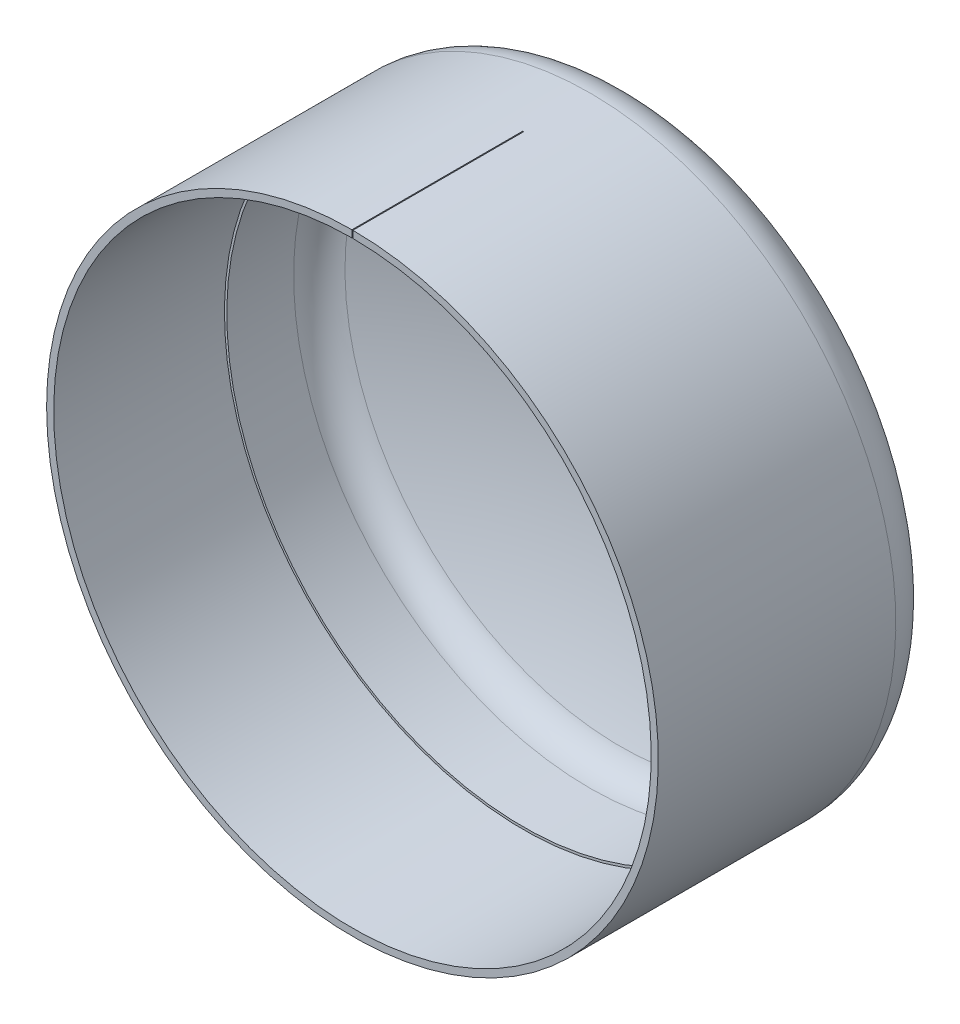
ISO-10303-21;
HEADER;
FILE_DESCRIPTION(('STEP AP214'),'2;1');
FILE_NAME('part.step','',(''),(''),'','','');
FILE_SCHEMA(('AUTOMOTIVE_DESIGN { 1 0 10303 214 1 1 1 1 }'));
ENDSEC;
DATA;
#1=APPLICATION_CONTEXT('core data for automotive mechanical design processes');
#2=APPLICATION_PROTOCOL_DEFINITION('international standard','automotive_design',2000,#1);
#3=PRODUCT_CONTEXT('',#1,'mechanical');
#4=PRODUCT('Part','Part','',(#3));
#5=PRODUCT_RELATED_PRODUCT_CATEGORY('part','',(#4));
#6=PRODUCT_DEFINITION_FORMATION('','',#4);
#7=PRODUCT_DEFINITION_CONTEXT('part definition',#1,'design');
#8=PRODUCT_DEFINITION('design','',#6,#7);
#9=PRODUCT_DEFINITION_SHAPE('','',#8);
#10=(LENGTH_UNIT() NAMED_UNIT(*) SI_UNIT(.MILLI.,.METRE.));
#11=(NAMED_UNIT(*) PLANE_ANGLE_UNIT() SI_UNIT($,.RADIAN.));
#12=(NAMED_UNIT(*) SI_UNIT($,.STERADIAN.) SOLID_ANGLE_UNIT());
#13=UNCERTAINTY_MEASURE_WITH_UNIT(LENGTH_MEASURE(1.E-05),#10,'distance_accuracy_value','');
#14=(GEOMETRIC_REPRESENTATION_CONTEXT(3) GLOBAL_UNCERTAINTY_ASSIGNED_CONTEXT((#13)) GLOBAL_UNIT_ASSIGNED_CONTEXT((#10,
#11,#12)) REPRESENTATION_CONTEXT('',''));
#15=CARTESIAN_POINT('',(0.,0.,0.));
#16=DIRECTION('',(0.,0.,1.));
#17=DIRECTION('',(1.,0.,0.));
#18=AXIS2_PLACEMENT_3D('',#15,#16,#17);
#19=CARTESIAN_POINT('',(204.502774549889,-121.470393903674,-116.874440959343));
#20=DIRECTION('',(0.61388628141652,-0.789394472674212,0.));
#21=DIRECTION('',(0.,0.,-1.));
#22=AXIS2_PLACEMENT_3D('',#19,#20,#21);
#23=SPHERICAL_SURFACE('',#22,153.580357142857);
#24=CARTESIAN_POINT('',(204.502774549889,-121.470393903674,-259.020332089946));
#25=DIRECTION('',(0.,0.,-1.));
#26=DIRECTION('',(0.789394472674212,0.61388628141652,0.));
#27=AXIS2_PLACEMENT_3D('',#24,#25,#26);
#28=CIRCLE('',#27,58.1504233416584);
#29=CARTESIAN_POINT('',(250.40639731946,-85.7726467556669,-259.020332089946));
#30=VERTEX_POINT('',#29);
#31=EDGE_CURVE('E21',#30,#30,#28,.F.);
#32=ORIENTED_EDGE('',*,*,#31,.T.);
#33=EDGE_LOOP('',(#32));
#34=FACE_BOUND('',#33,.T.);
#35=ADVANCED_FACE('F17',(#34),#23,.F.);
#36=CARTESIAN_POINT('',(204.502774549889,-121.470393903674,-252.541500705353));
#37=DIRECTION('',(0.,0.,-1.));
#38=DIRECTION('',(0.789394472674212,0.61388628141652,0.));
#39=AXIS2_PLACEMENT_3D('',#36,#37,#38);
#40=TOROIDAL_SURFACE('',#39,55.5,7.);
#41=CARTESIAN_POINT('',(204.502774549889,-121.470393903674,-252.541500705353));
#42=DIRECTION('',(0.,0.,-1.));
#43=DIRECTION('',(0.,1.,0.));
#44=AXIS2_PLACEMENT_3D('',#41,#42,#43);
#45=CIRCLE('',#44,62.5);
#46=CARTESIAN_POINT('',(204.502774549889,-58.970393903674,-252.541500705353));
#47=VERTEX_POINT('',#46);
#48=EDGE_CURVE('E70',#47,#47,#45,.F.);
#49=ORIENTED_EDGE('',*,*,#48,.T.);
#50=EDGE_LOOP('',(#49));
#51=FACE_BOUND('',#50,.T.);
#52=ORIENTED_EDGE('',*,*,#31,.F.);
#53=EDGE_LOOP('',(#52));
#54=FACE_BOUND('',#53,.T.);
#55=ADVANCED_FACE('F97',(#51,#54),#40,.F.);
#56=CARTESIAN_POINT('',(204.502774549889,-121.470393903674,-245.498149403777));
#57=DIRECTION('',(0.,0.,-1.));
#58=DIRECTION('',(0.,1.,0.));
#59=AXIS2_PLACEMENT_3D('',#56,#57,#58);
#60=CYLINDRICAL_SURFACE('',#59,62.5);
#61=CARTESIAN_POINT('',(204.502774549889,-121.470393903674,-238.4547981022));
#62=DIRECTION('',(0.,0.,-1.));
#63=DIRECTION('',(0.,1.,0.));
#64=AXIS2_PLACEMENT_3D('',#61,#62,#63);
#65=CIRCLE('',#64,62.5);
#66=CARTESIAN_POINT('',(204.502774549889,-58.970393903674,-238.4547981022));
#67=VERTEX_POINT('',#66);
#68=EDGE_CURVE('E77',#67,#67,#65,.T.);
#69=ORIENTED_EDGE('',*,*,#68,.F.);
#70=EDGE_LOOP('',(#69));
#71=FACE_BOUND('',#70,.T.);
#72=ORIENTED_EDGE('',*,*,#48,.F.);
#73=EDGE_LOOP('',(#72));
#74=FACE_BOUND('',#73,.T.);
#75=ADVANCED_FACE('F100',(#71,#74),#60,.F.);
#76=CARTESIAN_POINT('',(165.52099567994,-71.3438448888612,-238.4547981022));
#77=DIRECTION('',(0.,0.,1.));
#78=DIRECTION('',(0.,-1.,0.));
#79=AXIS2_PLACEMENT_3D('',#76,#77,#78);
#80=PLANE('',#79);
#81=ORIENTED_EDGE('',*,*,#68,.T.);
#82=EDGE_LOOP('',(#81));
#83=FACE_BOUND('',#82,.T.);
#84=DIRECTION('',(0.00158730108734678,0.999998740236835,0.));
#85=VECTOR('',#84,1.);
#86=CARTESIAN_POINT('',(204.602774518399,-58.4704732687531,-238.4547981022));
#87=LINE('',#86,#85);
#88=CARTESIAN_POINT('',(204.602774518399,-58.4704732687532,-238.4547981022));
#89=VERTEX_POINT('',#88);
#90=CARTESIAN_POINT('',(204.60515547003,-56.9704751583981,-238.4547981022));
#91=VERTEX_POINT('',#90);
#92=EDGE_CURVE('E69',#89,#91,#87,.T.);
#93=ORIENTED_EDGE('',*,*,#92,.T.);
#94=CARTESIAN_POINT('',(204.502774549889,-121.470393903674,-238.4547981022));
#95=DIRECTION('',(0.,0.,1.));
#96=DIRECTION('',(0.,-1.,0.));
#97=AXIS2_PLACEMENT_3D('',#94,#95,#96);
#98=CIRCLE('',#97,64.5);
#99=CARTESIAN_POINT('',(204.400393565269,-56.9704751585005,-238.4547981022));
#100=VERTEX_POINT('',#99);
#101=EDGE_CURVE('E56',#91,#100,#98,.T.);
#102=ORIENTED_EDGE('',*,*,#101,.T.);
#103=DIRECTION('',(0.00158730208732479,-0.999998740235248,0.));
#104=VECTOR('',#103,1.);
#105=CARTESIAN_POINT('',(204.400393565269,-56.9704751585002,-238.4547981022));
#106=LINE('',#105,#104);
#107=CARTESIAN_POINT('',(204.4027745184,-58.4704732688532,-238.4547981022));
#108=VERTEX_POINT('',#107);
#109=EDGE_CURVE('E62',#100,#108,#106,.T.);
#110=ORIENTED_EDGE('',*,*,#109,.T.);
#111=CARTESIAN_POINT('',(204.502774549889,-121.470393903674,-238.4547981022));
#112=DIRECTION('',(0.,0.,-1.));
#113=DIRECTION('',(-1.,0.,0.));
#114=AXIS2_PLACEMENT_3D('',#111,#112,#113);
#115=CIRCLE('',#114,63.);
#116=EDGE_CURVE('E79',#108,#89,#115,.F.);
#117=ORIENTED_EDGE('',*,*,#116,.T.);
#118=EDGE_LOOP('',(#93,#102,#110,#117));
#119=FACE_BOUND('',#118,.T.);
#120=ADVANCED_FACE('F76',(#83,#119),#80,.T.);
#121=CARTESIAN_POINT('',(204.502774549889,-121.470393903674,-116.874440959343));
#122=DIRECTION('',(0.61388628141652,-0.789394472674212,0.));
#123=DIRECTION('',(0.,0.,-1.));
#124=AXIS2_PLACEMENT_3D('',#121,#122,#123);
#125=SPHERICAL_SURFACE('',#124,155.580357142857);
#126=CARTESIAN_POINT('',(204.502774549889,-121.470393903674,-260.871426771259));
#127=DIRECTION('',(0.,0.,-1.));
#128=DIRECTION('',(0.789394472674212,0.61388628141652,0.));
#129=AXIS2_PLACEMENT_3D('',#126,#127,#128);
#130=CIRCLE('',#129,58.907687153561);
#131=CARTESIAN_POINT('',(251.004177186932,-85.3077728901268,-260.871426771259));
#132=VERTEX_POINT('',#131);
#133=EDGE_CURVE('E84',#132,#132,#130,.F.);
#134=ORIENTED_EDGE('',*,*,#133,.F.);
#135=EDGE_LOOP('',(#134));
#136=FACE_BOUND('',#135,.T.);
#137=ADVANCED_FACE('F107',(#136),#125,.T.);
#138=CARTESIAN_POINT('',(204.502774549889,-121.470393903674,-202.4547981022));
#139=DIRECTION('',(0.,0.,-1.));
#140=DIRECTION('',(-1.,0.,0.));
#141=AXIS2_PLACEMENT_3D('',#138,#139,#140);
#142=CYLINDRICAL_SURFACE('',#141,63.);
#143=CARTESIAN_POINT('',(204.502774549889,-121.470393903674,-202.4547981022));
#144=DIRECTION('',(0.,0.,-1.));
#145=DIRECTION('',(-1.,0.,0.));
#146=AXIS2_PLACEMENT_3D('',#143,#144,#145);
#147=CIRCLE('',#146,63.);
#148=CARTESIAN_POINT('',(204.602774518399,-58.4704732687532,-202.4547981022));
#149=VERTEX_POINT('',#148);
#150=CARTESIAN_POINT('',(204.4027745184,-58.4704732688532,-202.4547981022));
#151=VERTEX_POINT('',#150);
#152=EDGE_CURVE('E87',#149,#151,#147,.T.);
#153=ORIENTED_EDGE('',*,*,#152,.F.);
#154=DIRECTION('',(0.,0.,1.));
#155=VECTOR('',#154,1.);
#156=CARTESIAN_POINT('',(204.602774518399,-58.4704732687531,-220.4547981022));
#157=LINE('',#156,#155);
#158=EDGE_CURVE('E117',#89,#149,#157,.T.);
#159=ORIENTED_EDGE('',*,*,#158,.F.);
#160=ORIENTED_EDGE('',*,*,#116,.F.);
#161=DIRECTION('',(0.,0.,1.));
#162=VECTOR('',#161,1.);
#163=CARTESIAN_POINT('',(204.4027745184,-58.470473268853,-220.4547981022));
#164=LINE('',#163,#162);
#165=EDGE_CURVE('E65',#151,#108,#164,.F.);
#166=ORIENTED_EDGE('',*,*,#165,.F.);
#167=EDGE_LOOP('',(#153,#159,#160,#166));
#168=FACE_BOUND('',#167,.T.);
#169=ADVANCED_FACE('F112',(#168),#142,.F.);
#170=CARTESIAN_POINT('',(204.502774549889,-121.470393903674,-252.541500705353));
#171=DIRECTION('',(0.,0.,-1.));
#172=DIRECTION('',(0.789394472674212,0.61388628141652,0.));
#173=AXIS2_PLACEMENT_3D('',#170,#171,#172);
#174=TOROIDAL_SURFACE('',#173,55.5,9.);
#175=CARTESIAN_POINT('',(204.502774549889,-121.470393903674,-252.541500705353));
#176=DIRECTION('',(0.,0.,-1.));
#177=DIRECTION('',(-1.,0.,0.));
#178=AXIS2_PLACEMENT_3D('',#175,#176,#177);
#179=CIRCLE('',#178,64.5);
#180=CARTESIAN_POINT('',(140.002774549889,-121.470393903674,-252.541500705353));
#181=VERTEX_POINT('',#180);
#182=EDGE_CURVE('E92',#181,#181,#179,.F.);
#183=ORIENTED_EDGE('',*,*,#182,.F.);
#184=EDGE_LOOP('',(#183));
#185=FACE_BOUND('',#184,.T.);
#186=ORIENTED_EDGE('',*,*,#133,.T.);
#187=EDGE_LOOP('',(#186));
#188=FACE_BOUND('',#187,.T.);
#189=ADVANCED_FACE('F122',(#185,#188),#174,.T.);
#190=CARTESIAN_POINT('',(204.4027745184,-58.470473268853,-220.4547981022));
#191=DIRECTION('',(0.999998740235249,0.00158730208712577,0.));
#192=DIRECTION('',(-0.00158730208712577,0.999998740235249,0.));
#193=AXIS2_PLACEMENT_3D('',#190,#191,#192);
#194=PLANE('',#193);
#195=ORIENTED_EDGE('',*,*,#165,.T.);
#196=ORIENTED_EDGE('',*,*,#109,.F.);
#197=DIRECTION('',(0.,0.,-1.));
#198=VECTOR('',#197,1.);
#199=CARTESIAN_POINT('',(204.400393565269,-56.9704751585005,-202.4547981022));
#200=LINE('',#199,#198);
#201=CARTESIAN_POINT('',(204.400393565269,-56.9704751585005,-202.4547981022));
#202=VERTEX_POINT('',#201);
#203=EDGE_CURVE('E27',#202,#100,#200,.T.);
#204=ORIENTED_EDGE('',*,*,#203,.F.);
#205=DIRECTION('',(-0.00158730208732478,0.999998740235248,0.));
#206=VECTOR('',#205,1.);
#207=CARTESIAN_POINT('',(204.4027745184,-58.470473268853,-202.4547981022));
#208=LINE('',#207,#206);
#209=EDGE_CURVE('E90',#151,#202,#208,.T.);
#210=ORIENTED_EDGE('',*,*,#209,.F.);
#211=EDGE_LOOP('',(#195,#196,#204,#210));
#212=FACE_BOUND('',#211,.T.);
#213=ADVANCED_FACE('F63',(#212),#194,.T.);
#214=CARTESIAN_POINT('',(204.602774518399,-58.4704732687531,-220.4547981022));
#215=DIRECTION('',(-0.999998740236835,0.00158730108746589,0.));
#216=DIRECTION('',(-0.00158730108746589,-0.999998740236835,0.));
#217=AXIS2_PLACEMENT_3D('',#214,#215,#216);
#218=PLANE('',#217);
#219=ORIENTED_EDGE('',*,*,#158,.T.);
#220=DIRECTION('',(-0.00158730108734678,-0.999998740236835,0.));
#221=VECTOR('',#220,1.);
#222=CARTESIAN_POINT('',(204.60515547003,-56.9704751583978,-202.4547981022));
#223=LINE('',#222,#221);
#224=CARTESIAN_POINT('',(204.60515547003,-56.9704751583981,-202.4547981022));
#225=VERTEX_POINT('',#224);
#226=EDGE_CURVE('E91',#225,#149,#223,.T.);
#227=ORIENTED_EDGE('',*,*,#226,.F.);
#228=DIRECTION('',(0.,0.,-1.));
#229=VECTOR('',#228,1.);
#230=CARTESIAN_POINT('',(204.60515547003,-56.9704751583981,-202.4547981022));
#231=LINE('',#230,#229);
#232=EDGE_CURVE('E11',#91,#225,#231,.F.);
#233=ORIENTED_EDGE('',*,*,#232,.F.);
#234=ORIENTED_EDGE('',*,*,#92,.F.);
#235=EDGE_LOOP('',(#219,#227,#233,#234));
#236=FACE_BOUND('',#235,.T.);
#237=ADVANCED_FACE('F128',(#236),#218,.T.);
#238=CARTESIAN_POINT('',(204.502774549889,-121.470393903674,-202.4547981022));
#239=DIRECTION('',(0.,0.,1.));
#240=DIRECTION('',(1.,0.,0.));
#241=AXIS2_PLACEMENT_3D('',#238,#239,#240);
#242=PLANE('',#241);
#243=CARTESIAN_POINT('',(204.502774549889,-121.470393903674,-202.4547981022));
#244=DIRECTION('',(0.,0.,-1.));
#245=DIRECTION('',(-1.,0.,0.));
#246=AXIS2_PLACEMENT_3D('',#243,#244,#245);
#247=CIRCLE('',#246,64.5);
#248=EDGE_CURVE('E36',#225,#202,#247,.T.);
#249=ORIENTED_EDGE('',*,*,#248,.F.);
#250=ORIENTED_EDGE('',*,*,#226,.T.);
#251=ORIENTED_EDGE('',*,*,#152,.T.);
#252=ORIENTED_EDGE('',*,*,#209,.T.);
#253=EDGE_LOOP('',(#249,#250,#251,#252));
#254=FACE_BOUND('',#253,.T.);
#255=ADVANCED_FACE('F131',(#254),#242,.T.);
#256=CARTESIAN_POINT('',(204.502774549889,-121.470393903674,-202.4547981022));
#257=DIRECTION('',(0.,0.,-1.));
#258=DIRECTION('',(-1.,0.,0.));
#259=AXIS2_PLACEMENT_3D('',#256,#257,#258);
#260=CYLINDRICAL_SURFACE('',#259,64.5);
#261=ORIENTED_EDGE('',*,*,#232,.T.);
#262=ORIENTED_EDGE('',*,*,#248,.T.);
#263=ORIENTED_EDGE('',*,*,#203,.T.);
#264=ORIENTED_EDGE('',*,*,#101,.F.);
#265=EDGE_LOOP('',(#261,#262,#263,#264));
#266=FACE_BOUND('',#265,.T.);
#267=ORIENTED_EDGE('',*,*,#182,.T.);
#268=EDGE_LOOP('',(#267));
#269=FACE_BOUND('',#268,.T.);
#270=ADVANCED_FACE('F72',(#266,#269),#260,.T.);
#271=CLOSED_SHELL('',(#35,#55,#75,#120,#137,#169,#189,#213,#237,#255,#270));
#272=MANIFOLD_SOLID_BREP('B1',#271);
#273=ADVANCED_BREP_SHAPE_REPRESENTATION('',(#18,#272),#14);
#274=SHAPE_DEFINITION_REPRESENTATION(#9,#273);
ENDSEC;
END-ISO-10303-21;
